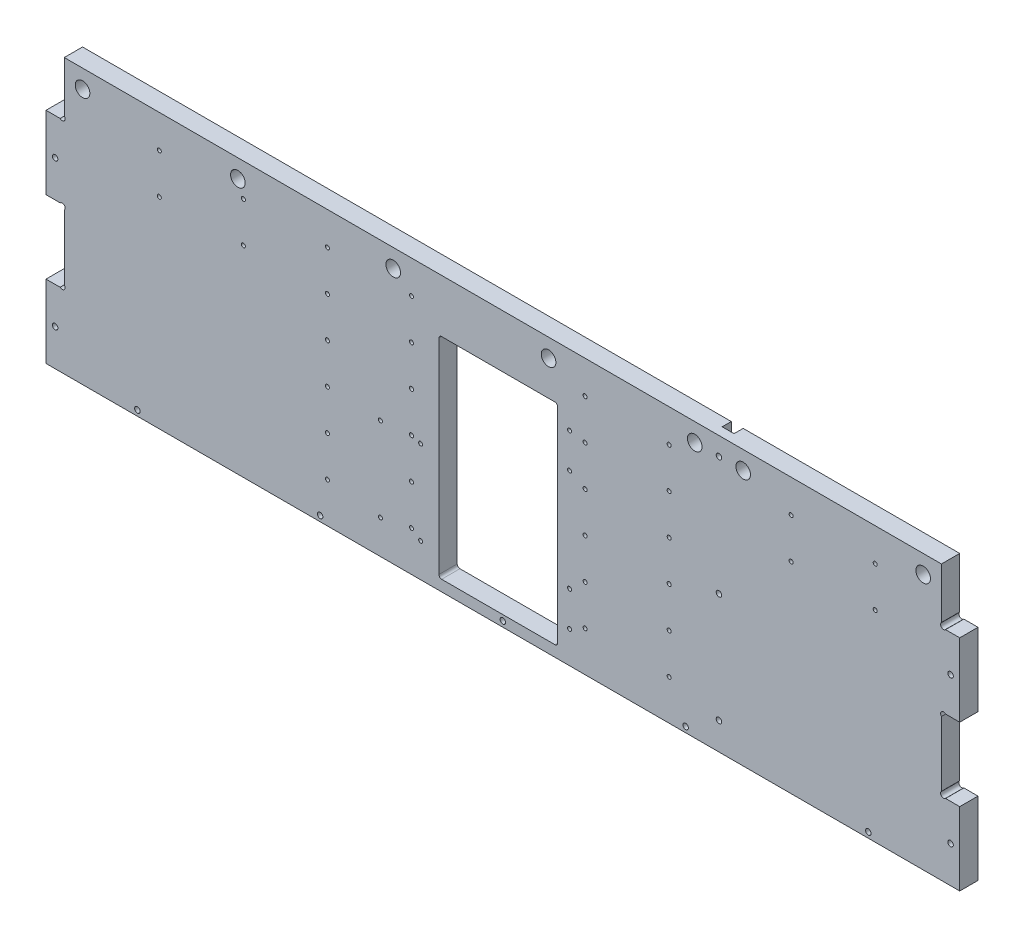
from build123d import *

# Parameters (mm, degrees)
EXTRUSION1_DEPTH                     = 10
ESQUISSE2_R                          = 1.6
ENL_V_MAT_ENFOURCHEMENT_DEPTH        = 523.111099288
ESQUISSE3_R                          = 1.5
ENL_V_MAT_FIXATION_SOL_ET_MURS_DEPTH = 523.111099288
ESQUISSE4_R                          = 4
ENL_V_MAT_EXTRU_1_DEPTH              = 523.111099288
ESQUISSE6_W                          = 6.5
ESQUISSE6_H                          = 150
ENL_V_MAT_EXTRU_4_DEPTH              = 5
ESQUISSE9_R                          = 1.5
ENL_V_MAT_EXTRU_5_DEPTH              = 523.039270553
ESQUISSE10_R                         = 4
ENL_V_MAT_EXTRU_6_DEPTH              = 523.111099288
ENL_V_MAT_EXTRU_7_PORTE_DEPTH        = 523.111099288
ESQUISSE13_R                         = 1.1
ENL_V_MAT_EXTRU_8_TRAME_DEPTH        = 523.111099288
ESQUISSE14_R                         = 1.1
ENL_V_MAT_EXTRU_7_DEPTH              = 523.111099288
ESQUISSE15_R                         = 1.1
ENL_V_MAT_EXTRU_8_DEPTH              = 523.111099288


with BuildPart() as part:
    # Esquisse1 → Extrusion1 (new body)
    with BuildSketch(Plane.XY):
        Polygon((0, 0), (500, 0), (500, 40), (490, 40), (490, 80), (500, 80), (500, 120), (490, 120), (490, 150), (10, 150), (10, 120), (0, 120), (0, 80), (10, 80), (10, 40), (0, 40), align=None)
    extrude(amount=EXTRUSION1_DEPTH)

    # Esquisse2 → Enl_v. mat.-enfourchement (cut, through all)
    with BuildSketch(Plane.XY.offset(10)):
        with Locations((8.86862915, 121.13137085)):
            Circle(ESQUISSE2_R)
        with Locations((8.86862915, 78.86862915)):
            Circle(ESQUISSE2_R)
        with Locations((8.86862915, 41.13137085)):
            Circle(ESQUISSE2_R)
        with Locations((491.13137085, 121.13137085)):
            Circle(ESQUISSE2_R)
        with Locations((491.13137085, 78.86862915)):
            Circle(ESQUISSE2_R)
        with Locations((491.13137085, 41.13137085)):
            Circle(ESQUISSE2_R)
    extrude(amount=-ENL_V_MAT_ENFOURCHEMENT_DEPTH, mode=Mode.SUBTRACT)

    # Esquisse3 → Enl_v. mat.-fixation sol et murs (cut, through all)
    with BuildSketch(Plane.XY.offset(10)):
        with Locations((5, 20)):
            Circle(ESQUISSE3_R)
        with Locations((5, 100)):
            Circle(ESQUISSE3_R)
        with Locations((495, 20)):
            Circle(ESQUISSE3_R)
        with Locations((495, 100)):
            Circle(ESQUISSE3_R)
        with Locations((250, 3)):
            Circle(ESQUISSE3_R)
        with Locations((50, 3)):
            Circle(ESQUISSE3_R)
        with Locations((150, 3)):
            Circle(ESQUISSE3_R)
        with Locations((450, 3)):
            Circle(ESQUISSE3_R)
        with Locations((350, 3)):
            Circle(ESQUISSE3_R)
    extrude(amount=-ENL_V_MAT_FIXATION_SOL_ET_MURS_DEPTH, mode=Mode.SUBTRACT)

    # Esquisse4 → Enl_v. mat.-Extru.1 (cut, through all)
    with BuildSketch(Plane.XY.offset(10)):
        with Locations((480, 140)):
            Circle(ESQUISSE4_R)
        with Locations((20, 140)):
            Circle(ESQUISSE4_R)
    extrude(amount=-ENL_V_MAT_EXTRU_1_DEPTH, mode=Mode.SUBTRACT)

    # Esquisse6 → Enl_v. mat.-Extru.4 (cut)
    with BuildSketch(Plane(origin=(0, 0, 0), x_dir=(-1, 0, 0), z_dir=(0, 0, -1))):
        with Locations((-368.25, 75)):
            Rectangle(ESQUISSE6_W, ESQUISSE6_H)
    extrude(amount=-ENL_V_MAT_EXTRU_4_DEPTH, mode=Mode.SUBTRACT)

    # Esquisse9 → Enl_v. mat.-Extru.5 (cut, through all)
    with BuildSketch(Plane(origin=(0, 0, 5), x_dir=(-1, 0, 0), z_dir=(0, 0, -1))):
        with Locations((-368.25, 140)):
            Circle(ESQUISSE9_R)
        with Locations((-368.25, 75)):
            Circle(ESQUISSE9_R)
        with Locations((-368.25, 15)):
            Circle(ESQUISSE9_R)
    extrude(amount=-ENL_V_MAT_EXTRU_5_DEPTH, mode=Mode.SUBTRACT)

    # Esquisse10 → Enl_v. mat.-Extru.6 (cut, through all)
    with BuildSketch(Plane(origin=(0, 0, 0), x_dir=(-1, 0, 0), z_dir=(0, 0, -1))):
        with Locations((-381.5, 140)):
            Circle(ESQUISSE10_R)
        with Locations((-355, 140)):
            Circle(ESQUISSE10_R)
        with Locations((-190, 140)):
            Circle(ESQUISSE10_R)
        with Locations((-105, 140)):
            Circle(ESQUISSE10_R)
        with Locations((-275, 140)):
            Circle(ESQUISSE10_R)
    extrude(amount=-ENL_V_MAT_EXTRU_6_DEPTH, mode=Mode.SUBTRACT)

    # Esquisse12 → Enl_v. mat.-Extru.7_porte (cut, through all)
    with BuildSketch(Plane(origin=(0, 0, 0), x_dir=(-1, 0, 0), z_dir=(0, 0, -1))):
        with BuildLine():
            Line((-280, 119.5), (-280, 7.5))
            ThreePointArc((-280, 7.5), (-279.560660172, 6.439339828), (-278.5, 6))
            Line((-278.5, 6), (-216.5, 6))
            ThreePointArc((-216.5, 6), (-215.439339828, 6.439339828), (-215, 7.5))
            Line((-215, 7.5), (-215, 119.5))
            ThreePointArc((-215, 119.5), (-215.439339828, 120.560660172), (-216.5, 121))
            Line((-216.5, 121), (-278.5, 121))
            ThreePointArc((-278.5, 121), (-279.560660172, 120.560660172), (-280, 119.5))
        make_face()
    extrude(amount=-ENL_V_MAT_EXTRU_7_PORTE_DEPTH, mode=Mode.SUBTRACT)

    # Esquisse13 → Enl_v. mat.-Extru.8_trame (cut, through all)
    with BuildSketch(Plane(origin=(0, 0, 0), x_dir=(-1, 0, 0), z_dir=(0, 0, -1))):
        with Locations((-453.75, 132)):
            Circle(ESQUISSE13_R)
        with Locations((-453.75, 110)):
            Circle(ESQUISSE13_R)
        with Locations((-407.75, 110)):
            Circle(ESQUISSE13_R)
        with Locations((-407.75, 132)):
            Circle(ESQUISSE13_R)
        with Locations((-341, 132)):
            Circle(ESQUISSE13_R)
        with Locations((-295, 132)):
            Circle(ESQUISSE13_R)
        with Locations((-295, 110)):
            Circle(ESQUISSE13_R)
        with Locations((-341, 110)):
            Circle(ESQUISSE13_R)
        with Locations((-341, 88)):
            Circle(ESQUISSE13_R)
        with Locations((-295, 88)):
            Circle(ESQUISSE13_R)
        with Locations((-295, 66)):
            Circle(ESQUISSE13_R)
        with Locations((-295, 44)):
            Circle(ESQUISSE13_R)
        with Locations((-295, 22)):
            Circle(ESQUISSE13_R)
        with Locations((-341, 22)):
            Circle(ESQUISSE13_R)
        with Locations((-341, 44)):
            Circle(ESQUISSE13_R)
        with Locations((-341, 66)):
            Circle(ESQUISSE13_R)
        with Locations((-200, 132)):
            Circle(ESQUISSE13_R)
        with Locations((-154, 132)):
            Circle(ESQUISSE13_R)
        with Locations((-154, 110)):
            Circle(ESQUISSE13_R)
        with Locations((-200, 110)):
            Circle(ESQUISSE13_R)
        with Locations((-200, 88)):
            Circle(ESQUISSE13_R)
        with Locations((-154, 88)):
            Circle(ESQUISSE13_R)
        with Locations((-154, 66)):
            Circle(ESQUISSE13_R)
        with Locations((-154, 44)):
            Circle(ESQUISSE13_R)
        with Locations((-154, 22)):
            Circle(ESQUISSE13_R)
        with Locations((-200, 22)):
            Circle(ESQUISSE13_R)
        with Locations((-200, 44)):
            Circle(ESQUISSE13_R)
        with Locations((-200, 66)):
            Circle(ESQUISSE13_R)
        with Locations((-108, 110)):
            Circle(ESQUISSE13_R)
        with Locations((-62, 110)):
            Circle(ESQUISSE13_R)
        with Locations((-62, 132)):
            Circle(ESQUISSE13_R)
        with Locations((-108, 132)):
            Circle(ESQUISSE13_R)
    extrude(amount=-ENL_V_MAT_EXTRU_8_TRAME_DEPTH, mode=Mode.SUBTRACT)

    # Esquisse14 → Enl_v. mat.-Extru.7 (cut, through all)
    with BuildSketch(Plane(origin=(0, 0, 0), x_dir=(-1, 0, 0), z_dir=(0, 0, -1))):
        with Locations((-286.5, 111.5)):
            Circle(ESQUISSE14_R)
        with Locations((-286.5, 92.5)):
            Circle(ESQUISSE14_R)
        with Locations((-286.5, 36.5)):
            Circle(ESQUISSE14_R)
        with Locations((-286.5, 17.5)):
            Circle(ESQUISSE14_R)
    extrude(amount=-ENL_V_MAT_EXTRU_7_DEPTH, mode=Mode.SUBTRACT)

    # Esquisse15 → Enl_v. mat.-Extru.8 (cut, through all)
    with BuildSketch(Plane(origin=(0, 0, 0), x_dir=(-1, 0, 0), z_dir=(0, 0, -1))):
        with Locations(Location((-205, 64.5, 0), (0, 0, 90))):
            Circle(ESQUISSE15_R)
        with Locations(Location((-183, 64.5, 0), (0, 0, 90))):
            Circle(ESQUISSE15_R)
        with Locations(Location((-183, 18.5, 0), (0, 0, 90))):
            Circle(ESQUISSE15_R)
        with Locations(Location((-205, 18.5, 0), (0, 0, 90))):
            Circle(ESQUISSE15_R)
    extrude(amount=-ENL_V_MAT_EXTRU_8_DEPTH, mode=Mode.SUBTRACT)


solid = part.part
